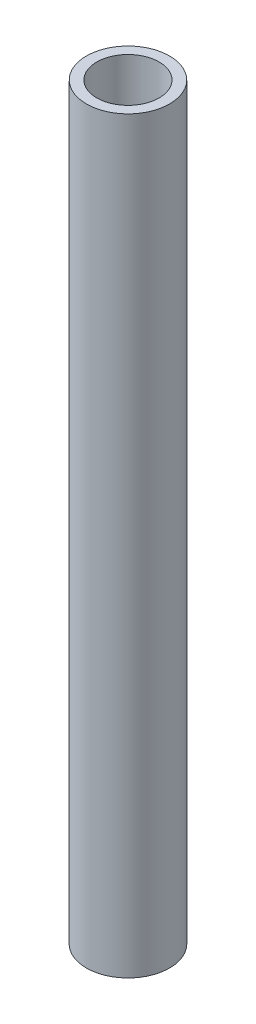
ISO-10303-21;
HEADER;
FILE_DESCRIPTION(('STEP AP214'),'2;1');
FILE_NAME('part.step','',(''),(''),'','','');
FILE_SCHEMA(('AUTOMOTIVE_DESIGN { 1 0 10303 214 1 1 1 1 }'));
ENDSEC;
DATA;
#1=APPLICATION_CONTEXT('core data for automotive mechanical design processes');
#2=APPLICATION_PROTOCOL_DEFINITION('international standard','automotive_design',2000,#1);
#3=PRODUCT_CONTEXT('',#1,'mechanical');
#4=PRODUCT('Part','Part','',(#3));
#5=PRODUCT_RELATED_PRODUCT_CATEGORY('part','',(#4));
#6=PRODUCT_DEFINITION_FORMATION('','',#4);
#7=PRODUCT_DEFINITION_CONTEXT('part definition',#1,'design');
#8=PRODUCT_DEFINITION('design','',#6,#7);
#9=PRODUCT_DEFINITION_SHAPE('','',#8);
#10=(LENGTH_UNIT() NAMED_UNIT(*) SI_UNIT(.MILLI.,.METRE.));
#11=(NAMED_UNIT(*) PLANE_ANGLE_UNIT() SI_UNIT($,.RADIAN.));
#12=(NAMED_UNIT(*) SI_UNIT($,.STERADIAN.) SOLID_ANGLE_UNIT());
#13=UNCERTAINTY_MEASURE_WITH_UNIT(LENGTH_MEASURE(1.E-05),#10,'distance_accuracy_value','');
#14=(GEOMETRIC_REPRESENTATION_CONTEXT(3) GLOBAL_UNCERTAINTY_ASSIGNED_CONTEXT((#13)) GLOBAL_UNIT_ASSIGNED_CONTEXT((#10,
#11,#12)) REPRESENTATION_CONTEXT('',''));
#15=CARTESIAN_POINT('',(0.,0.,0.));
#16=DIRECTION('',(0.,0.,1.));
#17=DIRECTION('',(1.,0.,0.));
#18=AXIS2_PLACEMENT_3D('',#15,#16,#17);
#19=CARTESIAN_POINT('',(0.,457.2,0.));
#20=DIRECTION('',(0.,1.,0.));
#21=DIRECTION('',(0.,0.,1.));
#22=AXIS2_PLACEMENT_3D('',#19,#20,#21);
#23=PLANE('',#22);
#24=CARTESIAN_POINT('',(0.,457.2,0.));
#25=DIRECTION('',(0.,1.,0.));
#26=DIRECTION('',(0.,0.,1.));
#27=AXIS2_PLACEMENT_3D('',#24,#25,#26);
#28=CIRCLE('',#27,25.4);
#29=CARTESIAN_POINT('',(0.,457.2,25.4));
#30=VERTEX_POINT('',#29);
#31=EDGE_CURVE('E10',#30,#30,#28,.T.);
#32=ORIENTED_EDGE('',*,*,#31,.T.);
#33=EDGE_LOOP('',(#32));
#34=FACE_BOUND('',#33,.T.);
#35=CARTESIAN_POINT('',(0.,457.2,0.));
#36=DIRECTION('',(0.,1.,0.));
#37=DIRECTION('',(0.,0.,1.));
#38=AXIS2_PLACEMENT_3D('',#35,#36,#37);
#39=CIRCLE('',#38,19.05);
#40=CARTESIAN_POINT('',(0.,457.2,19.05));
#41=VERTEX_POINT('',#40);
#42=EDGE_CURVE('E56',#41,#41,#39,.T.);
#43=ORIENTED_EDGE('',*,*,#42,.F.);
#44=EDGE_LOOP('',(#43));
#45=FACE_BOUND('',#44,.T.);
#46=ADVANCED_FACE('F43',(#34,#45),#23,.T.);
#47=CARTESIAN_POINT('',(0.,0.,0.));
#48=DIRECTION('',(0.,1.,0.));
#49=DIRECTION('',(0.,0.,1.));
#50=AXIS2_PLACEMENT_3D('',#47,#48,#49);
#51=PLANE('',#50);
#52=CARTESIAN_POINT('',(0.,0.,0.));
#53=DIRECTION('',(0.,1.,0.));
#54=DIRECTION('',(0.,0.,1.));
#55=AXIS2_PLACEMENT_3D('',#52,#53,#54);
#56=CIRCLE('',#55,25.4);
#57=CARTESIAN_POINT('',(0.,0.,25.4));
#58=VERTEX_POINT('',#57);
#59=EDGE_CURVE('E47',#58,#58,#56,.T.);
#60=ORIENTED_EDGE('',*,*,#59,.F.);
#61=EDGE_LOOP('',(#60));
#62=FACE_BOUND('',#61,.T.);
#63=CARTESIAN_POINT('',(0.,0.,0.));
#64=DIRECTION('',(0.,1.,0.));
#65=DIRECTION('',(0.,0.,1.));
#66=AXIS2_PLACEMENT_3D('',#63,#64,#65);
#67=CIRCLE('',#66,19.05);
#68=CARTESIAN_POINT('',(0.,0.,19.05));
#69=VERTEX_POINT('',#68);
#70=EDGE_CURVE('E58',#69,#69,#67,.T.);
#71=ORIENTED_EDGE('',*,*,#70,.T.);
#72=EDGE_LOOP('',(#71));
#73=FACE_BOUND('',#72,.T.);
#74=ADVANCED_FACE('F70',(#62,#73),#51,.F.);
#75=CARTESIAN_POINT('',(0.,457.2,0.));
#76=DIRECTION('',(0.,-1.,0.));
#77=DIRECTION('',(0.,0.,-1.));
#78=AXIS2_PLACEMENT_3D('',#75,#76,#77);
#79=CYLINDRICAL_SURFACE('',#78,25.4);
#80=ORIENTED_EDGE('',*,*,#31,.F.);
#81=EDGE_LOOP('',(#80));
#82=FACE_BOUND('',#81,.T.);
#83=ORIENTED_EDGE('',*,*,#59,.T.);
#84=EDGE_LOOP('',(#83));
#85=FACE_BOUND('',#84,.T.);
#86=ADVANCED_FACE('F45',(#82,#85),#79,.T.);
#87=CARTESIAN_POINT('',(0.,457.2,0.));
#88=DIRECTION('',(0.,-1.,0.));
#89=DIRECTION('',(0.,0.,-1.));
#90=AXIS2_PLACEMENT_3D('',#87,#88,#89);
#91=CYLINDRICAL_SURFACE('',#90,19.05);
#92=ORIENTED_EDGE('',*,*,#42,.T.);
#93=EDGE_LOOP('',(#92));
#94=FACE_BOUND('',#93,.T.);
#95=ORIENTED_EDGE('',*,*,#70,.F.);
#96=EDGE_LOOP('',(#95));
#97=FACE_BOUND('',#96,.T.);
#98=ADVANCED_FACE('F66',(#94,#97),#91,.F.);
#99=CLOSED_SHELL('',(#46,#74,#86,#98));
#100=MANIFOLD_SOLID_BREP('B2',#99);
#101=ADVANCED_BREP_SHAPE_REPRESENTATION('',(#18,#100),#14);
#102=SHAPE_DEFINITION_REPRESENTATION(#9,#101);
ENDSEC;
END-ISO-10303-21;
